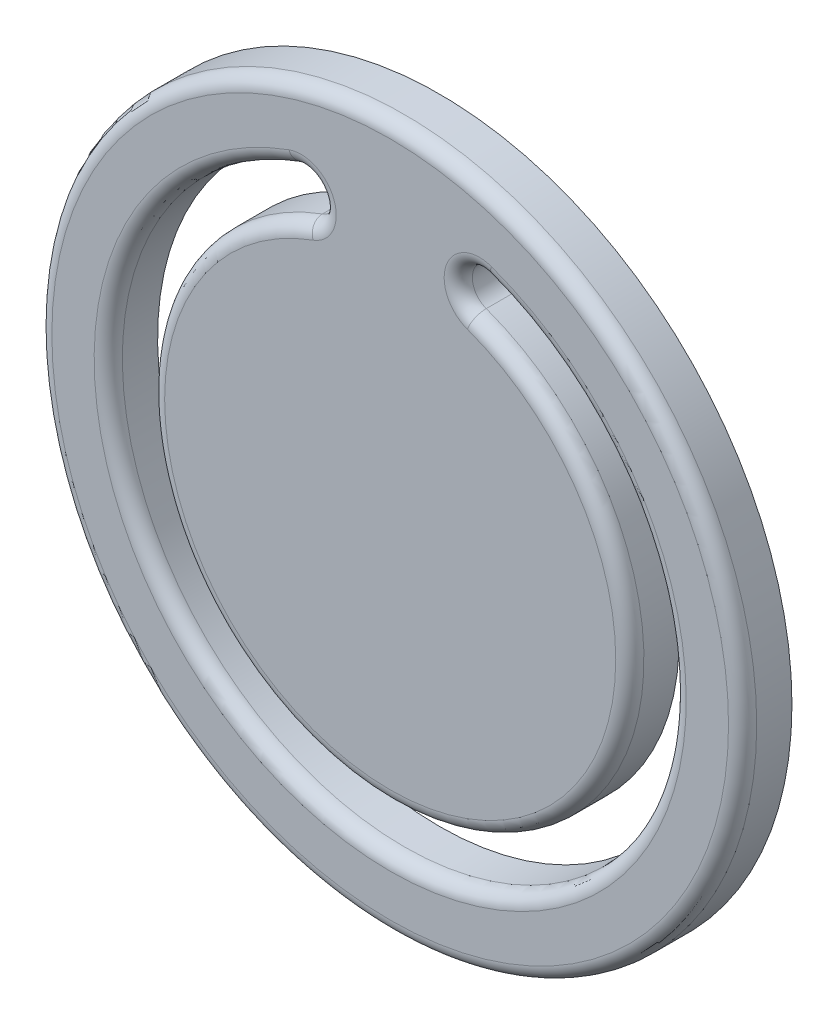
ISO-10303-21;
HEADER;
FILE_DESCRIPTION(('STEP AP214'),'2;1');
FILE_NAME('part.step','',(''),(''),'','','');
FILE_SCHEMA(('AUTOMOTIVE_DESIGN { 1 0 10303 214 1 1 1 1 }'));
ENDSEC;
DATA;
#1=APPLICATION_CONTEXT('core data for automotive mechanical design processes');
#2=APPLICATION_PROTOCOL_DEFINITION('international standard','automotive_design',2000,#1);
#3=PRODUCT_CONTEXT('',#1,'mechanical');
#4=PRODUCT('Part','Part','',(#3));
#5=PRODUCT_RELATED_PRODUCT_CATEGORY('part','',(#4));
#6=PRODUCT_DEFINITION_FORMATION('','',#4);
#7=PRODUCT_DEFINITION_CONTEXT('part definition',#1,'design');
#8=PRODUCT_DEFINITION('design','',#6,#7);
#9=PRODUCT_DEFINITION_SHAPE('','',#8);
#10=(LENGTH_UNIT() NAMED_UNIT(*) SI_UNIT(.MILLI.,.METRE.));
#11=(NAMED_UNIT(*) PLANE_ANGLE_UNIT() SI_UNIT($,.RADIAN.));
#12=(NAMED_UNIT(*) SI_UNIT($,.STERADIAN.) SOLID_ANGLE_UNIT());
#13=UNCERTAINTY_MEASURE_WITH_UNIT(LENGTH_MEASURE(1.E-05),#10,'distance_accuracy_value','');
#14=(GEOMETRIC_REPRESENTATION_CONTEXT(3) GLOBAL_UNCERTAINTY_ASSIGNED_CONTEXT((#13)) GLOBAL_UNIT_ASSIGNED_CONTEXT((#10,
#11,#12)) REPRESENTATION_CONTEXT('',''));
#15=CARTESIAN_POINT('',(0.,0.,0.));
#16=DIRECTION('',(0.,0.,1.));
#17=DIRECTION('',(1.,0.,0.));
#18=AXIS2_PLACEMENT_3D('',#15,#16,#17);
#19=CARTESIAN_POINT('',(0.,0.,3.5));
#20=DIRECTION('',(0.,0.,1.));
#21=DIRECTION('',(1.,0.,0.));
#22=AXIS2_PLACEMENT_3D('',#19,#20,#21);
#23=PLANE('',#22);
#24=CARTESIAN_POINT('',(6.32737265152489,17.3843134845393,3.5));
#25=DIRECTION('',(0.,0.,1.));
#26=DIRECTION('',(1.,0.,0.));
#27=AXIS2_PLACEMENT_3D('',#24,#25,#26);
#28=CIRCLE('',#27,2.5);
#29=CARTESIAN_POINT('',(5.4723222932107,15.0350819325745,3.5));
#30=VERTEX_POINT('',#29);
#31=CARTESIAN_POINT('',(7.18242300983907,19.7335450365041,3.5));
#32=VERTEX_POINT('',#31);
#33=EDGE_CURVE('E153',#30,#32,#28,.F.);
#34=ORIENTED_EDGE('',*,*,#33,.T.);
#35=CARTESIAN_POINT('',(0.,0.,3.5));
#36=DIRECTION('',(0.,0.,1.));
#37=DIRECTION('',(1.,0.,0.));
#38=AXIS2_PLACEMENT_3D('',#35,#36,#37);
#39=CIRCLE('',#38,21.);
#40=CARTESIAN_POINT('',(-7.18242300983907,19.7335450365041,3.5));
#41=VERTEX_POINT('',#40);
#42=EDGE_CURVE('E156',#32,#41,#39,.F.);
#43=ORIENTED_EDGE('',*,*,#42,.T.);
#44=CARTESIAN_POINT('',(-6.32737265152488,17.3843134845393,3.5));
#45=DIRECTION('',(0.,0.,1.));
#46=DIRECTION('',(1.,0.,0.));
#47=AXIS2_PLACEMENT_3D('',#44,#45,#46);
#48=CIRCLE('',#47,2.5);
#49=CARTESIAN_POINT('',(-5.47232229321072,15.0350819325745,3.5));
#50=VERTEX_POINT('',#49);
#51=EDGE_CURVE('E150',#41,#50,#48,.F.);
#52=ORIENTED_EDGE('',*,*,#51,.T.);
#53=CARTESIAN_POINT('',(0.,0.,3.5));
#54=DIRECTION('',(0.,0.,1.));
#55=DIRECTION('',(1.,0.,0.));
#56=AXIS2_PLACEMENT_3D('',#53,#54,#55);
#57=CIRCLE('',#56,16.);
#58=EDGE_CURVE('E147',#50,#30,#57,.T.);
#59=ORIENTED_EDGE('',*,*,#58,.T.);
#60=EDGE_LOOP('',(#34,#43,#52,#59));
#61=FACE_BOUND('',#60,.T.);
#62=CARTESIAN_POINT('',(0.,0.,3.5));
#63=DIRECTION('',(0.,0.,1.));
#64=DIRECTION('',(1.,0.,0.));
#65=AXIS2_PLACEMENT_3D('',#62,#63,#64);
#66=CIRCLE('',#65,24.);
#67=CARTESIAN_POINT('',(24.,0.,3.5));
#68=VERTEX_POINT('',#67);
#69=EDGE_CURVE('E135',#68,#68,#66,.T.);
#70=ORIENTED_EDGE('',*,*,#69,.T.);
#71=EDGE_LOOP('',(#70));
#72=FACE_BOUND('',#71,.T.);
#73=ADVANCED_FACE('F38',(#61,#72),#23,.T.);
#74=CARTESIAN_POINT('',(0.,0.,0.));
#75=DIRECTION('',(0.,0.,1.));
#76=DIRECTION('',(1.,0.,0.));
#77=AXIS2_PLACEMENT_3D('',#74,#75,#76);
#78=PLANE('',#77);
#79=CARTESIAN_POINT('',(0.,0.,0.));
#80=DIRECTION('',(0.,0.,1.));
#81=DIRECTION('',(1.,0.,0.));
#82=AXIS2_PLACEMENT_3D('',#79,#80,#81);
#83=CIRCLE('',#82,25.);
#84=CARTESIAN_POINT('',(25.,0.,0.));
#85=VERTEX_POINT('',#84);
#86=EDGE_CURVE('E98',#85,#85,#83,.T.);
#87=ORIENTED_EDGE('',*,*,#86,.F.);
#88=EDGE_LOOP('',(#87));
#89=FACE_BOUND('',#88,.T.);
#90=CARTESIAN_POINT('',(6.32737265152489,17.3843134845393,0.));
#91=DIRECTION('',(0.,0.,1.));
#92=DIRECTION('',(-1.,0.,0.));
#93=AXIS2_PLACEMENT_3D('',#90,#91,#92);
#94=CIRCLE('',#93,1.5);
#95=CARTESIAN_POINT('',(6.8404028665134,18.7938524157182,0.));
#96=VERTEX_POINT('',#95);
#97=CARTESIAN_POINT('',(5.81434243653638,15.9747745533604,0.));
#98=VERTEX_POINT('',#97);
#99=EDGE_CURVE('E95',#96,#98,#94,.T.);
#100=ORIENTED_EDGE('',*,*,#99,.T.);
#101=CARTESIAN_POINT('',(0.,0.,0.));
#102=DIRECTION('',(0.,0.,-1.));
#103=DIRECTION('',(1.,0.,0.));
#104=AXIS2_PLACEMENT_3D('',#101,#102,#103);
#105=CIRCLE('',#104,17.);
#106=CARTESIAN_POINT('',(-5.81434243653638,15.9747745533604,0.));
#107=VERTEX_POINT('',#106);
#108=EDGE_CURVE('E102',#98,#107,#105,.T.);
#109=ORIENTED_EDGE('',*,*,#108,.T.);
#110=CARTESIAN_POINT('',(-6.32737265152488,17.3843134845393,0.));
#111=DIRECTION('',(0.,0.,1.));
#112=DIRECTION('',(1.,0.,0.));
#113=AXIS2_PLACEMENT_3D('',#110,#111,#112);
#114=CIRCLE('',#113,1.5);
#115=CARTESIAN_POINT('',(-6.8404028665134,18.7938524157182,0.));
#116=VERTEX_POINT('',#115);
#117=EDGE_CURVE('E108',#107,#116,#114,.T.);
#118=ORIENTED_EDGE('',*,*,#117,.T.);
#119=CARTESIAN_POINT('',(0.,0.,0.));
#120=DIRECTION('',(0.,0.,1.));
#121=DIRECTION('',(1.,0.,0.));
#122=AXIS2_PLACEMENT_3D('',#119,#120,#121);
#123=CIRCLE('',#122,20.);
#124=EDGE_CURVE('E112',#116,#96,#123,.T.);
#125=ORIENTED_EDGE('',*,*,#124,.T.);
#126=EDGE_LOOP('',(#100,#109,#118,#125));
#127=FACE_BOUND('',#126,.T.);
#128=ADVANCED_FACE('F110',(#89,#127),#78,.F.);
#129=CARTESIAN_POINT('',(0.,0.,3.5));
#130=DIRECTION('',(0.,0.,-1.));
#131=DIRECTION('',(-1.,0.,0.));
#132=AXIS2_PLACEMENT_3D('',#129,#130,#131);
#133=CYLINDRICAL_SURFACE('',#132,25.);
#134=CARTESIAN_POINT('',(0.,0.,2.5));
#135=DIRECTION('',(0.,0.,1.));
#136=DIRECTION('',(1.,0.,0.));
#137=AXIS2_PLACEMENT_3D('',#134,#135,#136);
#138=CIRCLE('',#137,25.);
#139=CARTESIAN_POINT('',(25.,0.,2.5));
#140=VERTEX_POINT('',#139);
#141=EDGE_CURVE('E139',#140,#140,#138,.F.);
#142=ORIENTED_EDGE('',*,*,#141,.T.);
#143=EDGE_LOOP('',(#142));
#144=FACE_BOUND('',#143,.T.);
#145=ORIENTED_EDGE('',*,*,#86,.T.);
#146=EDGE_LOOP('',(#145));
#147=FACE_BOUND('',#146,.T.);
#148=ADVANCED_FACE('F210',(#144,#147),#133,.T.);
#149=CARTESIAN_POINT('',(6.32737265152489,17.3843134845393,3.5));
#150=DIRECTION('',(0.,0.,-1.));
#151=DIRECTION('',(-1.,0.,0.));
#152=AXIS2_PLACEMENT_3D('',#149,#150,#151);
#153=CYLINDRICAL_SURFACE('',#152,1.5);
#154=DIRECTION('',(0.,0.,-1.));
#155=VECTOR('',#154,1.);
#156=CARTESIAN_POINT('',(6.8404028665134,18.7938524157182,3.5));
#157=LINE('',#156,#155);
#158=CARTESIAN_POINT('',(6.8404028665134,18.7938524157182,2.5));
#159=VERTEX_POINT('',#158);
#160=EDGE_CURVE('E124',#159,#96,#157,.T.);
#161=ORIENTED_EDGE('',*,*,#160,.F.);
#162=CARTESIAN_POINT('',(6.32737265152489,17.3843134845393,2.5));
#163=DIRECTION('',(0.,0.,1.));
#164=DIRECTION('',(1.,0.,0.));
#165=AXIS2_PLACEMENT_3D('',#162,#163,#164);
#166=CIRCLE('',#165,1.5);
#167=CARTESIAN_POINT('',(5.81434243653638,15.9747745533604,2.5));
#168=VERTEX_POINT('',#167);
#169=EDGE_CURVE('E62',#159,#168,#166,.T.);
#170=ORIENTED_EDGE('',*,*,#169,.T.);
#171=DIRECTION('',(0.,0.,-1.));
#172=VECTOR('',#171,1.);
#173=CARTESIAN_POINT('',(5.81434243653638,15.9747745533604,3.5));
#174=LINE('',#173,#172);
#175=EDGE_CURVE('E91',#168,#98,#174,.T.);
#176=ORIENTED_EDGE('',*,*,#175,.T.);
#177=ORIENTED_EDGE('',*,*,#99,.F.);
#178=EDGE_LOOP('',(#161,#170,#176,#177));
#179=FACE_BOUND('',#178,.T.);
#180=ADVANCED_FACE('F93',(#179),#153,.F.);
#181=CARTESIAN_POINT('',(0.,0.,3.5));
#182=DIRECTION('',(0.,0.,-1.));
#183=DIRECTION('',(-1.,0.,0.));
#184=AXIS2_PLACEMENT_3D('',#181,#182,#183);
#185=CYLINDRICAL_SURFACE('',#184,17.);
#186=ORIENTED_EDGE('',*,*,#175,.F.);
#187=CARTESIAN_POINT('',(0.,0.,2.5));
#188=DIRECTION('',(0.,0.,1.));
#189=DIRECTION('',(1.,0.,0.));
#190=AXIS2_PLACEMENT_3D('',#187,#188,#189);
#191=CIRCLE('',#190,17.);
#192=CARTESIAN_POINT('',(-5.81434243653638,15.9747745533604,2.5));
#193=VERTEX_POINT('',#192);
#194=EDGE_CURVE('E11',#168,#193,#191,.F.);
#195=ORIENTED_EDGE('',*,*,#194,.T.);
#196=DIRECTION('',(0.,0.,-1.));
#197=VECTOR('',#196,1.);
#198=CARTESIAN_POINT('',(-5.81434243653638,15.9747745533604,3.5));
#199=LINE('',#198,#197);
#200=EDGE_CURVE('E99',#193,#107,#199,.T.);
#201=ORIENTED_EDGE('',*,*,#200,.T.);
#202=ORIENTED_EDGE('',*,*,#108,.F.);
#203=EDGE_LOOP('',(#186,#195,#201,#202));
#204=FACE_BOUND('',#203,.T.);
#205=ADVANCED_FACE('F103',(#204),#185,.T.);
#206=CARTESIAN_POINT('',(-6.32737265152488,17.3843134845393,3.5));
#207=DIRECTION('',(0.,0.,-1.));
#208=DIRECTION('',(-1.,0.,0.));
#209=AXIS2_PLACEMENT_3D('',#206,#207,#208);
#210=CYLINDRICAL_SURFACE('',#209,1.5);
#211=ORIENTED_EDGE('',*,*,#200,.F.);
#212=CARTESIAN_POINT('',(-6.32737265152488,17.3843134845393,2.5));
#213=DIRECTION('',(0.,0.,1.));
#214=DIRECTION('',(1.,0.,0.));
#215=AXIS2_PLACEMENT_3D('',#212,#213,#214);
#216=CIRCLE('',#215,1.5);
#217=CARTESIAN_POINT('',(-6.8404028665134,18.7938524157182,2.5));
#218=VERTEX_POINT('',#217);
#219=EDGE_CURVE('E48',#193,#218,#216,.T.);
#220=ORIENTED_EDGE('',*,*,#219,.T.);
#221=DIRECTION('',(0.,0.,-1.));
#222=VECTOR('',#221,1.);
#223=CARTESIAN_POINT('',(-6.8404028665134,18.7938524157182,3.5));
#224=LINE('',#223,#222);
#225=EDGE_CURVE('E127',#218,#116,#224,.T.);
#226=ORIENTED_EDGE('',*,*,#225,.T.);
#227=ORIENTED_EDGE('',*,*,#117,.F.);
#228=EDGE_LOOP('',(#211,#220,#226,#227));
#229=FACE_BOUND('',#228,.T.);
#230=ADVANCED_FACE('F186',(#229),#210,.F.);
#231=CARTESIAN_POINT('',(0.,0.,3.5));
#232=DIRECTION('',(0.,0.,-1.));
#233=DIRECTION('',(-1.,0.,0.));
#234=AXIS2_PLACEMENT_3D('',#231,#232,#233);
#235=CYLINDRICAL_SURFACE('',#234,20.);
#236=ORIENTED_EDGE('',*,*,#225,.F.);
#237=CARTESIAN_POINT('',(0.,0.,2.5));
#238=DIRECTION('',(0.,0.,1.));
#239=DIRECTION('',(1.,0.,0.));
#240=AXIS2_PLACEMENT_3D('',#237,#238,#239);
#241=CIRCLE('',#240,20.);
#242=EDGE_CURVE('E143',#218,#159,#241,.T.);
#243=ORIENTED_EDGE('',*,*,#242,.T.);
#244=ORIENTED_EDGE('',*,*,#160,.T.);
#245=ORIENTED_EDGE('',*,*,#124,.F.);
#246=EDGE_LOOP('',(#236,#243,#244,#245));
#247=FACE_BOUND('',#246,.T.);
#248=ADVANCED_FACE('F188',(#247),#235,.F.);
#249=CARTESIAN_POINT('',(0.,0.,2.5));
#250=DIRECTION('',(0.,0.,1.));
#251=DIRECTION('',(1.,0.,0.));
#252=AXIS2_PLACEMENT_3D('',#249,#250,#251);
#253=TOROIDAL_SURFACE('',#252,24.,1.);
#254=ORIENTED_EDGE('',*,*,#141,.F.);
#255=EDGE_LOOP('',(#254));
#256=FACE_BOUND('',#255,.T.);
#257=ORIENTED_EDGE('',*,*,#69,.F.);
#258=EDGE_LOOP('',(#257));
#259=FACE_BOUND('',#258,.T.);
#260=ADVANCED_FACE('F198',(#256,#259),#253,.T.);
#261=CARTESIAN_POINT('',(0.,0.,2.5));
#262=DIRECTION('',(0.,0.,1.));
#263=DIRECTION('',(1.,0.,0.));
#264=AXIS2_PLACEMENT_3D('',#261,#262,#263);
#265=TOROIDAL_SURFACE('',#264,16.,1.);
#266=CARTESIAN_POINT('',(5.4723222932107,15.0350819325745,2.5));
#267=DIRECTION('',(-0.939692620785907,0.342020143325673,0.));
#268=DIRECTION('',(-0.342020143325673,-0.939692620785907,0.));
#269=AXIS2_PLACEMENT_3D('',#266,#267,#268);
#270=CIRCLE('',#269,1.);
#271=EDGE_CURVE('E119',#30,#168,#270,.T.);
#272=ORIENTED_EDGE('',*,*,#271,.F.);
#273=ORIENTED_EDGE('',*,*,#58,.F.);
#274=CARTESIAN_POINT('',(-5.47232229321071,15.0350819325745,2.5));
#275=DIRECTION('',(0.939692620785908,0.34202014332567,0.));
#276=DIRECTION('',(-0.34202014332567,0.939692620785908,0.));
#277=AXIS2_PLACEMENT_3D('',#274,#275,#276);
#278=CIRCLE('',#277,1.);
#279=EDGE_CURVE('E42',#193,#50,#278,.T.);
#280=ORIENTED_EDGE('',*,*,#279,.F.);
#281=ORIENTED_EDGE('',*,*,#194,.F.);
#282=EDGE_LOOP('',(#272,#273,#280,#281));
#283=FACE_BOUND('',#282,.T.);
#284=ADVANCED_FACE('F40',(#283),#265,.T.);
#285=CARTESIAN_POINT('',(-6.32737265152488,17.3843134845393,2.5));
#286=DIRECTION('',(0.,0.,1.));
#287=DIRECTION('',(1.,0.,0.));
#288=AXIS2_PLACEMENT_3D('',#285,#286,#287);
#289=TOROIDAL_SURFACE('',#288,2.5,1.);
#290=ORIENTED_EDGE('',*,*,#279,.T.);
#291=ORIENTED_EDGE('',*,*,#51,.F.);
#292=CARTESIAN_POINT('',(-7.18242300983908,19.7335450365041,2.5));
#293=DIRECTION('',(-0.939692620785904,-0.34202014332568,0.));
#294=DIRECTION('',(0.34202014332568,-0.939692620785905,0.));
#295=AXIS2_PLACEMENT_3D('',#292,#293,#294);
#296=CIRCLE('',#295,1.);
#297=EDGE_CURVE('E166',#218,#41,#296,.T.);
#298=ORIENTED_EDGE('',*,*,#297,.F.);
#299=ORIENTED_EDGE('',*,*,#219,.F.);
#300=EDGE_LOOP('',(#290,#291,#298,#299));
#301=FACE_BOUND('',#300,.T.);
#302=ADVANCED_FACE('F182',(#301),#289,.T.);
#303=CARTESIAN_POINT('',(6.32737265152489,17.3843134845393,2.5));
#304=DIRECTION('',(0.,0.,1.));
#305=DIRECTION('',(1.,0.,0.));
#306=AXIS2_PLACEMENT_3D('',#303,#304,#305);
#307=TOROIDAL_SURFACE('',#306,2.5,1.);
#308=ORIENTED_EDGE('',*,*,#271,.T.);
#309=ORIENTED_EDGE('',*,*,#169,.F.);
#310=CARTESIAN_POINT('',(7.18242300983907,19.7335450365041,2.5));
#311=DIRECTION('',(0.939692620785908,-0.342020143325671,0.));
#312=DIRECTION('',(0.342020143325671,0.939692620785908,0.));
#313=AXIS2_PLACEMENT_3D('',#310,#311,#312);
#314=CIRCLE('',#313,1.);
#315=EDGE_CURVE('E164',#32,#159,#314,.T.);
#316=ORIENTED_EDGE('',*,*,#315,.F.);
#317=ORIENTED_EDGE('',*,*,#33,.F.);
#318=EDGE_LOOP('',(#308,#309,#316,#317));
#319=FACE_BOUND('',#318,.T.);
#320=ADVANCED_FACE('F173',(#319),#307,.T.);
#321=CARTESIAN_POINT('',(0.,0.,2.5));
#322=DIRECTION('',(0.,0.,1.));
#323=DIRECTION('',(1.,0.,0.));
#324=AXIS2_PLACEMENT_3D('',#321,#322,#323);
#325=TOROIDAL_SURFACE('',#324,21.,1.);
#326=ORIENTED_EDGE('',*,*,#297,.T.);
#327=ORIENTED_EDGE('',*,*,#42,.F.);
#328=ORIENTED_EDGE('',*,*,#315,.T.);
#329=ORIENTED_EDGE('',*,*,#242,.F.);
#330=EDGE_LOOP('',(#326,#327,#328,#329));
#331=FACE_BOUND('',#330,.T.);
#332=ADVANCED_FACE('F190',(#331),#325,.T.);
#333=CLOSED_SHELL('',(#73,#128,#148,#180,#205,#230,#248,#260,#284,#302,#320,#332));
#334=MANIFOLD_SOLID_BREP('B2',#333);
#335=ADVANCED_BREP_SHAPE_REPRESENTATION('',(#18,#334),#14);
#336=SHAPE_DEFINITION_REPRESENTATION(#9,#335);
ENDSEC;
END-ISO-10303-21;
